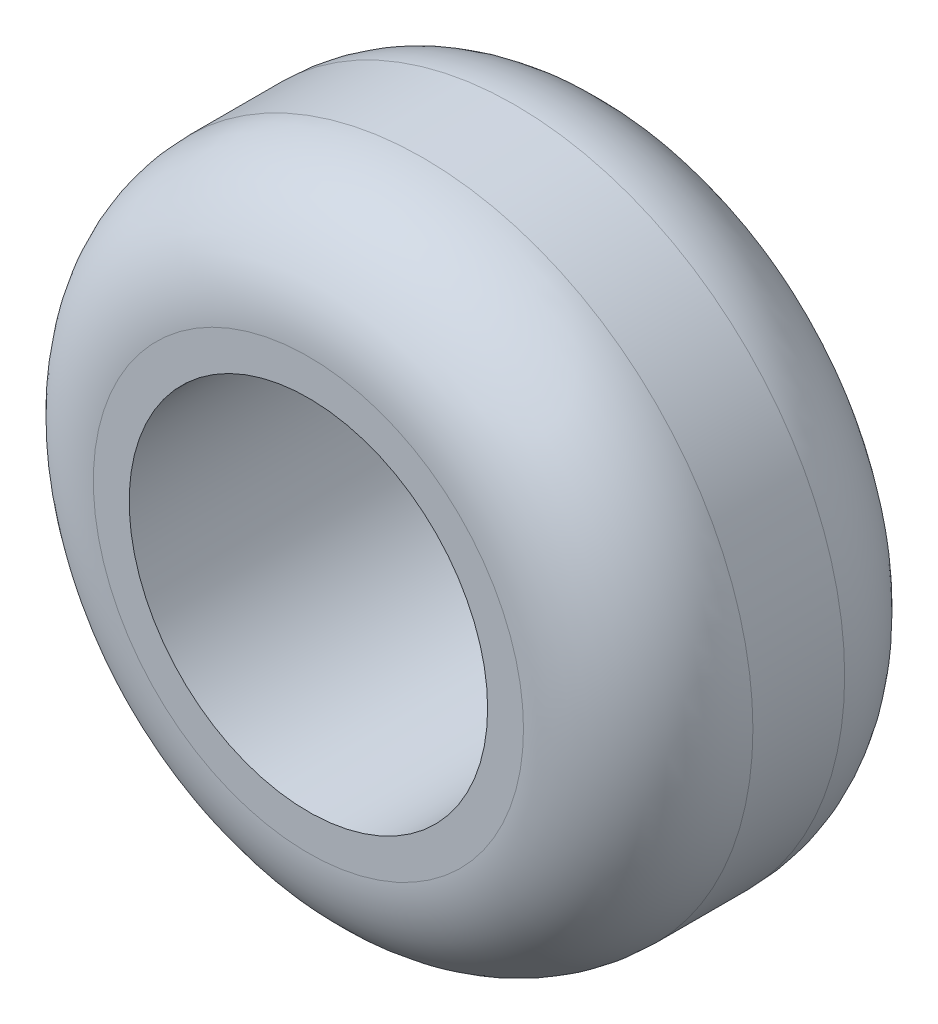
from build123d import *

# Parameters (mm, degrees)
ESQUISSE1_R          = 115
ESQUISSE1_R_2        = 62.5
BASE_EXTRUSION_DEPTH = 112
CONG_1_R             = 40


with BuildPart() as part:
    # Esquisse1 → Base-Extrusion (new body)
    with BuildSketch(Plane.XY):
        Circle(ESQUISSE1_R)
        Circle(ESQUISSE1_R_2, mode=Mode.SUBTRACT)
    extrude(amount=BASE_EXTRUSION_DEPTH)

    # Cong_1
    cong_1_edges = [part.edges().sort_by_distance(p)[0] for p in [
        (-115, 0, 0),
        (-115, 0, 112),
    ]]
    fillet(cong_1_edges, radius=CONG_1_R)


solid = part.part
